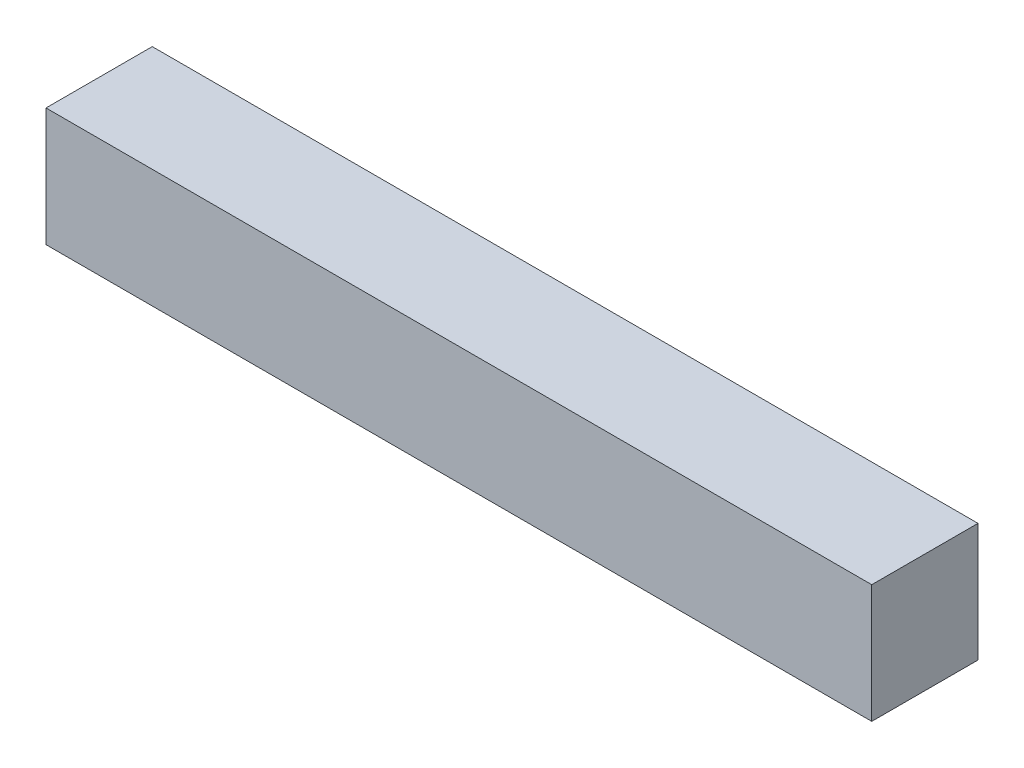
ISO-10303-21;
HEADER;
FILE_DESCRIPTION(('STEP AP214'),'2;1');
FILE_NAME('part.step','',(''),(''),'','','');
FILE_SCHEMA(('AUTOMOTIVE_DESIGN { 1 0 10303 214 1 1 1 1 }'));
ENDSEC;
DATA;
#1=APPLICATION_CONTEXT('core data for automotive mechanical design processes');
#2=APPLICATION_PROTOCOL_DEFINITION('international standard','automotive_design',2000,#1);
#3=PRODUCT_CONTEXT('',#1,'mechanical');
#4=PRODUCT('Part','Part','',(#3));
#5=PRODUCT_RELATED_PRODUCT_CATEGORY('part','',(#4));
#6=PRODUCT_DEFINITION_FORMATION('','',#4);
#7=PRODUCT_DEFINITION_CONTEXT('part definition',#1,'design');
#8=PRODUCT_DEFINITION('design','',#6,#7);
#9=PRODUCT_DEFINITION_SHAPE('','',#8);
#10=(LENGTH_UNIT() NAMED_UNIT(*) SI_UNIT(.MILLI.,.METRE.));
#11=(NAMED_UNIT(*) PLANE_ANGLE_UNIT() SI_UNIT($,.RADIAN.));
#12=(NAMED_UNIT(*) SI_UNIT($,.STERADIAN.) SOLID_ANGLE_UNIT());
#13=UNCERTAINTY_MEASURE_WITH_UNIT(LENGTH_MEASURE(1.E-05),#10,'distance_accuracy_value','');
#14=(GEOMETRIC_REPRESENTATION_CONTEXT(3) GLOBAL_UNCERTAINTY_ASSIGNED_CONTEXT((#13)) GLOBAL_UNIT_ASSIGNED_CONTEXT((#10,
#11,#12)) REPRESENTATION_CONTEXT('',''));
#15=CARTESIAN_POINT('',(0.,0.,0.));
#16=DIRECTION('',(0.,0.,1.));
#17=DIRECTION('',(1.,0.,0.));
#18=AXIS2_PLACEMENT_3D('',#15,#16,#17);
#19=CARTESIAN_POINT('',(-125.622489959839,35.1378848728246,35.));
#20=DIRECTION('',(1.,0.,0.));
#21=DIRECTION('',(0.,0.,-1.));
#22=AXIS2_PLACEMENT_3D('',#19,#20,#21);
#23=PLANE('',#22);
#24=DIRECTION('',(0.,-1.,0.));
#25=VECTOR('',#24,1.);
#26=CARTESIAN_POINT('',(-125.622489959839,35.1378848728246,0.));
#27=LINE('',#26,#25);
#28=CARTESIAN_POINT('',(-125.622489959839,35.1378848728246,0.));
#29=VERTEX_POINT('',#28);
#30=CARTESIAN_POINT('',(-125.622489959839,-3.86211512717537,0.));
#31=VERTEX_POINT('',#30);
#32=EDGE_CURVE('E95',#29,#31,#27,.T.);
#33=ORIENTED_EDGE('',*,*,#32,.T.);
#34=DIRECTION('',(0.,0.,-1.));
#35=VECTOR('',#34,1.);
#36=CARTESIAN_POINT('',(-125.622489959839,-3.86211512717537,35.));
#37=LINE('',#36,#35);
#38=CARTESIAN_POINT('',(-125.622489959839,-3.86211512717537,35.));
#39=VERTEX_POINT('',#38);
#40=EDGE_CURVE('E11',#39,#31,#37,.T.);
#41=ORIENTED_EDGE('',*,*,#40,.F.);
#42=DIRECTION('',(0.,-1.,0.));
#43=VECTOR('',#42,1.);
#44=CARTESIAN_POINT('',(-125.622489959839,35.1378848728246,35.));
#45=LINE('',#44,#43);
#46=CARTESIAN_POINT('',(-125.622489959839,35.1378848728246,35.));
#47=VERTEX_POINT('',#46);
#48=EDGE_CURVE('E83',#47,#39,#45,.T.);
#49=ORIENTED_EDGE('',*,*,#48,.F.);
#50=DIRECTION('',(0.,0.,-1.));
#51=VECTOR('',#50,1.);
#52=CARTESIAN_POINT('',(-125.622489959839,35.1378848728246,35.));
#53=LINE('',#52,#51);
#54=EDGE_CURVE('E91',#47,#29,#53,.T.);
#55=ORIENTED_EDGE('',*,*,#54,.T.);
#56=EDGE_LOOP('',(#33,#41,#49,#55));
#57=FACE_BOUND('',#56,.T.);
#58=ADVANCED_FACE('F32',(#57),#23,.F.);
#59=CARTESIAN_POINT('',(-125.622489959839,-3.86211512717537,35.));
#60=DIRECTION('',(0.,1.,0.));
#61=DIRECTION('',(0.,0.,1.));
#62=AXIS2_PLACEMENT_3D('',#59,#60,#61);
#63=PLANE('',#62);
#64=DIRECTION('',(1.,0.,0.));
#65=VECTOR('',#64,1.);
#66=CARTESIAN_POINT('',(-125.622489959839,-3.86211512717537,0.));
#67=LINE('',#66,#65);
#68=CARTESIAN_POINT('',(146.377510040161,-3.86211512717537,0.));
#69=VERTEX_POINT('',#68);
#70=EDGE_CURVE('E87',#31,#69,#67,.T.);
#71=ORIENTED_EDGE('',*,*,#70,.T.);
#72=DIRECTION('',(0.,0.,-1.));
#73=VECTOR('',#72,1.);
#74=CARTESIAN_POINT('',(146.377510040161,-3.86211512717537,35.));
#75=LINE('',#74,#73);
#76=CARTESIAN_POINT('',(146.377510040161,-3.86211512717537,35.));
#77=VERTEX_POINT('',#76);
#78=EDGE_CURVE('E40',#77,#69,#75,.T.);
#79=ORIENTED_EDGE('',*,*,#78,.F.);
#80=DIRECTION('',(1.,0.,0.));
#81=VECTOR('',#80,1.);
#82=CARTESIAN_POINT('',(-125.622489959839,-3.86211512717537,35.));
#83=LINE('',#82,#81);
#84=EDGE_CURVE('E78',#39,#77,#83,.T.);
#85=ORIENTED_EDGE('',*,*,#84,.F.);
#86=ORIENTED_EDGE('',*,*,#40,.T.);
#87=EDGE_LOOP('',(#71,#79,#85,#86));
#88=FACE_BOUND('',#87,.T.);
#89=ADVANCED_FACE('F86',(#88),#63,.F.);
#90=CARTESIAN_POINT('',(146.377510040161,35.1378848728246,35.));
#91=DIRECTION('',(-1.,0.,0.));
#92=DIRECTION('',(0.,0.,1.));
#93=AXIS2_PLACEMENT_3D('',#90,#91,#92);
#94=PLANE('',#93);
#95=DIRECTION('',(0.,1.,0.));
#96=VECTOR('',#95,1.);
#97=CARTESIAN_POINT('',(146.377510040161,35.1378848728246,0.));
#98=LINE('',#97,#96);
#99=CARTESIAN_POINT('',(146.377510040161,35.1378848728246,0.));
#100=VERTEX_POINT('',#99);
#101=EDGE_CURVE('E65',#69,#100,#98,.T.);
#102=ORIENTED_EDGE('',*,*,#101,.T.);
#103=DIRECTION('',(0.,0.,-1.));
#104=VECTOR('',#103,1.);
#105=CARTESIAN_POINT('',(146.377510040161,35.1378848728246,35.));
#106=LINE('',#105,#104);
#107=CARTESIAN_POINT('',(146.377510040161,35.1378848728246,35.));
#108=VERTEX_POINT('',#107);
#109=EDGE_CURVE('E88',#108,#100,#106,.T.);
#110=ORIENTED_EDGE('',*,*,#109,.F.);
#111=DIRECTION('',(0.,1.,0.));
#112=VECTOR('',#111,1.);
#113=CARTESIAN_POINT('',(146.377510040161,35.1378848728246,35.));
#114=LINE('',#113,#112);
#115=EDGE_CURVE('E81',#77,#108,#114,.T.);
#116=ORIENTED_EDGE('',*,*,#115,.F.);
#117=ORIENTED_EDGE('',*,*,#78,.T.);
#118=EDGE_LOOP('',(#102,#110,#116,#117));
#119=FACE_BOUND('',#118,.T.);
#120=ADVANCED_FACE('F89',(#119),#94,.F.);
#121=CARTESIAN_POINT('',(-125.622489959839,35.1378848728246,35.));
#122=DIRECTION('',(0.,-1.,0.));
#123=DIRECTION('',(0.,0.,-1.));
#124=AXIS2_PLACEMENT_3D('',#121,#122,#123);
#125=PLANE('',#124);
#126=DIRECTION('',(-1.,0.,0.));
#127=VECTOR('',#126,1.);
#128=CARTESIAN_POINT('',(-125.622489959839,35.1378848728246,0.));
#129=LINE('',#128,#127);
#130=EDGE_CURVE('E71',#100,#29,#129,.T.);
#131=ORIENTED_EDGE('',*,*,#130,.T.);
#132=ORIENTED_EDGE('',*,*,#54,.F.);
#133=DIRECTION('',(-1.,0.,0.));
#134=VECTOR('',#133,1.);
#135=CARTESIAN_POINT('',(-125.622489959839,35.1378848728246,35.));
#136=LINE('',#135,#134);
#137=EDGE_CURVE('E48',#108,#47,#136,.T.);
#138=ORIENTED_EDGE('',*,*,#137,.F.);
#139=ORIENTED_EDGE('',*,*,#109,.T.);
#140=EDGE_LOOP('',(#131,#132,#138,#139));
#141=FACE_BOUND('',#140,.T.);
#142=ADVANCED_FACE('F102',(#141),#125,.F.);
#143=CARTESIAN_POINT('',(0.,0.,35.));
#144=DIRECTION('',(0.,0.,1.));
#145=DIRECTION('',(1.,0.,0.));
#146=AXIS2_PLACEMENT_3D('',#143,#144,#145);
#147=PLANE('',#146);
#148=ORIENTED_EDGE('',*,*,#48,.T.);
#149=ORIENTED_EDGE('',*,*,#84,.T.);
#150=ORIENTED_EDGE('',*,*,#115,.T.);
#151=ORIENTED_EDGE('',*,*,#137,.T.);
#152=EDGE_LOOP('',(#148,#149,#150,#151));
#153=FACE_BOUND('',#152,.T.);
#154=ADVANCED_FACE('F79',(#153),#147,.T.);
#155=CARTESIAN_POINT('',(0.,0.,0.));
#156=DIRECTION('',(0.,0.,1.));
#157=DIRECTION('',(1.,0.,0.));
#158=AXIS2_PLACEMENT_3D('',#155,#156,#157);
#159=PLANE('',#158);
#160=ORIENTED_EDGE('',*,*,#32,.F.);
#161=ORIENTED_EDGE('',*,*,#130,.F.);
#162=ORIENTED_EDGE('',*,*,#101,.F.);
#163=ORIENTED_EDGE('',*,*,#70,.F.);
#164=EDGE_LOOP('',(#160,#161,#162,#163));
#165=FACE_BOUND('',#164,.T.);
#166=ADVANCED_FACE('F105',(#165),#159,.F.);
#167=CLOSED_SHELL('',(#58,#89,#120,#142,#154,#166));
#168=MANIFOLD_SOLID_BREP('B2',#167);
#169=ADVANCED_BREP_SHAPE_REPRESENTATION('',(#18,#168),#14);
#170=SHAPE_DEFINITION_REPRESENTATION(#9,#169);
ENDSEC;
END-ISO-10303-21;
